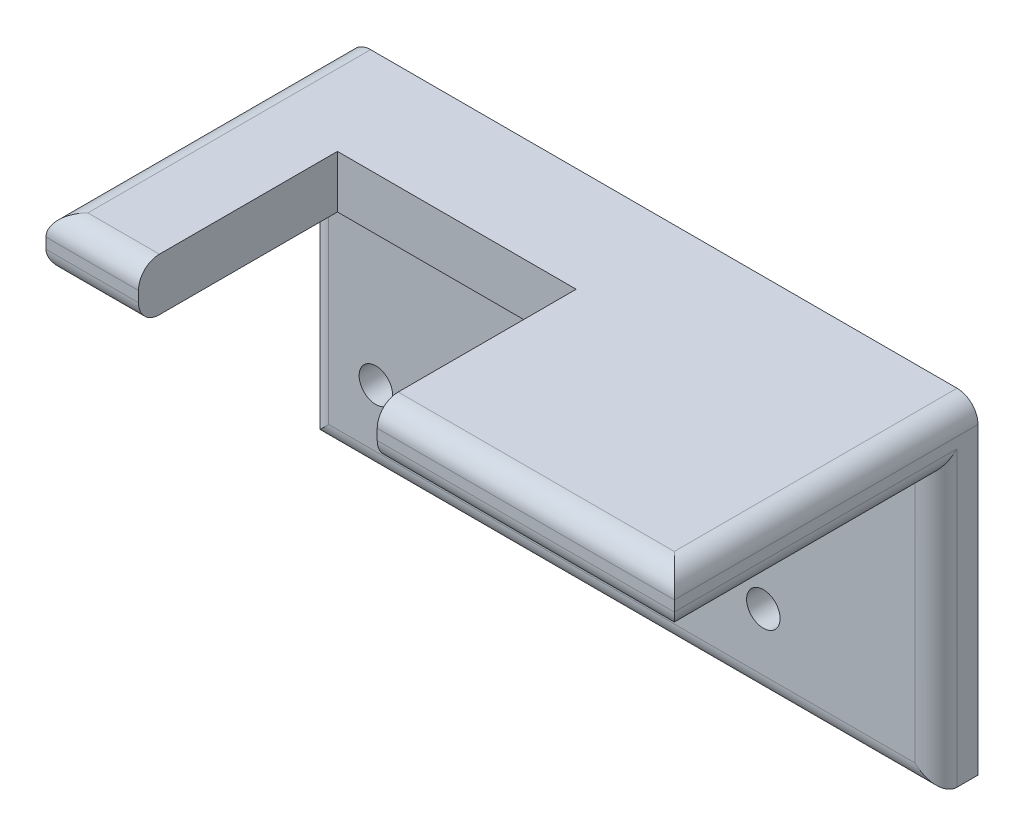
from build123d import *

# Parameters (mm, degrees)
ESQUISSE1_W             = 60
ESQUISSE1_H             = 31
ESQUISSE1_R             = 1.6
BOSS_EXTRU_1_DEPTH      = 4
ESQUISSE3_W             = 60
ESQUISSE3_H             = 5.010149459
BOSS_EXTRU_2_DEPTH      = 25
ENL_V_MAT_EXTRU_1_REACH = 57.018
ESQUISSE4_W             = 22.8
ESQUISSE4_H             = 19
CONG_1_R                = 2


with BuildPart() as part:
    # Esquisse1 → Boss.-Extru.1 (new body)
    with BuildSketch(Plane.XY):
        with Locations((5, 0.5)):
            Rectangle(ESQUISSE1_W, ESQUISSE1_H)
        with Locations((-18.5, 7.5)):
            Circle(ESQUISSE1_R, mode=Mode.SUBTRACT)
        with Locations((-18.5, -7.5)):
            Circle(ESQUISSE1_R, mode=Mode.SUBTRACT)
        Circle(ESQUISSE1_R, mode=Mode.SUBTRACT)
        with Locations((18.5, 7.5)):
            Circle(ESQUISSE1_R, mode=Mode.SUBTRACT)
        with Locations((18.5, -7.5)):
            Circle(ESQUISSE1_R, mode=Mode.SUBTRACT)
    extrude(amount=BOSS_EXTRU_1_DEPTH)

    # Esquisse3 → Boss.-Extru.2 (add)
    with BuildSketch(Plane.XY.offset(4)):
        with Locations((5, 13.494925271)):
            Rectangle(ESQUISSE3_W, ESQUISSE3_H)
    extrude(amount=BOSS_EXTRU_2_DEPTH)

    # Esquisse4 → Enl_v. mat.-Extru.1 (cut, up to next)
    with BuildSketch(Plane(origin=(0, 16, 0), x_dir=(1, 0, 0), z_dir=(0, 1, 0)), mode=Mode.PRIVATE) as enl_v_mat_extru_1_sk1:
        with Locations((-4.770693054, -19.5)):
            Rectangle(ESQUISSE4_W, ESQUISSE4_H)
    enl_v_mat_extru_1_tool1 = extrude(enl_v_mat_extru_1_sk1.sketch, amount=-ENL_V_MAT_EXTRU_1_REACH, mode=Mode.PRIVATE) & part.part
    add(enl_v_mat_extru_1_tool1.solids().sort_by_distance((-4.770693, 16, 19.5))[0], mode=Mode.SUBTRACT)

    # Cong_1
    cong_1_edges = [part.edges().sort_by_distance(p)[0] for p in [
        (35, -2.00507473, 4),
        (-25, -2.00507473, 4),
        (-25, 10.989850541, 16.5),
        (35, 10.989850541, 16.5),
        (-20.585346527, 10.989850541, 29),
        (20.814653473, 16, 29),
        (20.814653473, 10.989850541, 29),
        (-20.585346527, 16, 29),
        (-25, 16, 14.5),
        (35, 16, 14.5),
        (5, -15, 4),
    ]]
    fillet(cong_1_edges, radius=CONG_1_R)


solid = part.part
